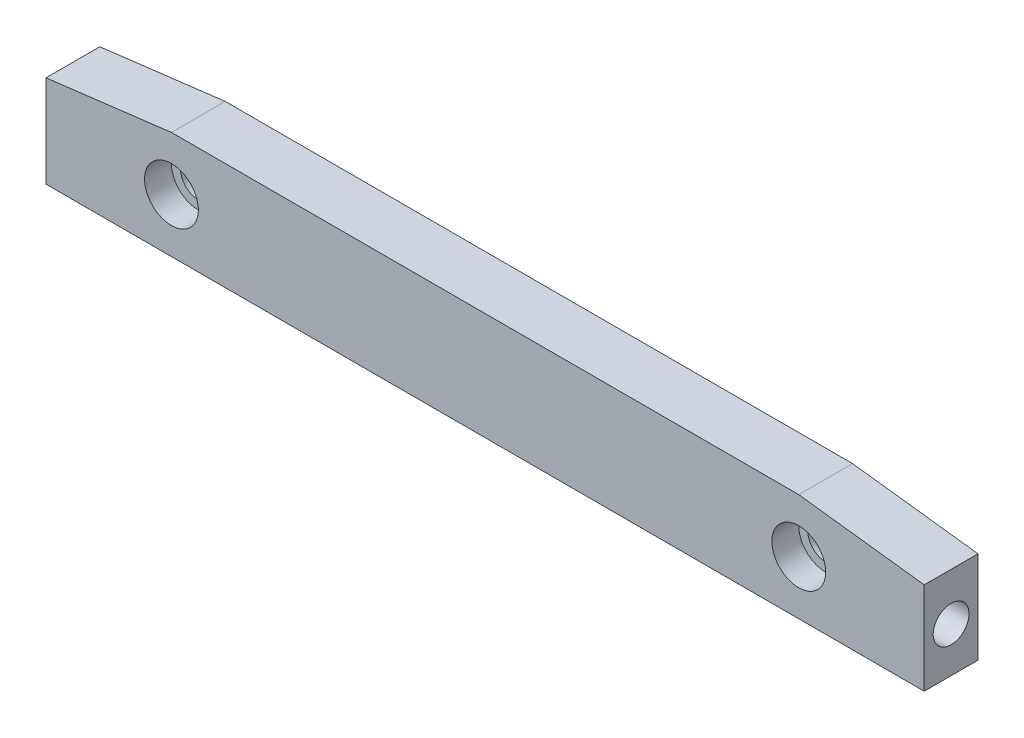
ISO-10303-21;
HEADER;
FILE_DESCRIPTION(('STEP AP214'),'2;1');
FILE_NAME('part.step','',(''),(''),'','','');
FILE_SCHEMA(('AUTOMOTIVE_DESIGN { 1 0 10303 214 1 1 1 1 }'));
ENDSEC;
DATA;
#1=APPLICATION_CONTEXT('core data for automotive mechanical design processes');
#2=APPLICATION_PROTOCOL_DEFINITION('international standard','automotive_design',2000,#1);
#3=PRODUCT_CONTEXT('',#1,'mechanical');
#4=PRODUCT('Part','Part','',(#3));
#5=PRODUCT_RELATED_PRODUCT_CATEGORY('part','',(#4));
#6=PRODUCT_DEFINITION_FORMATION('','',#4);
#7=PRODUCT_DEFINITION_CONTEXT('part definition',#1,'design');
#8=PRODUCT_DEFINITION('design','',#6,#7);
#9=PRODUCT_DEFINITION_SHAPE('','',#8);
#10=(LENGTH_UNIT() NAMED_UNIT(*) SI_UNIT(.MILLI.,.METRE.));
#11=(NAMED_UNIT(*) PLANE_ANGLE_UNIT() SI_UNIT($,.RADIAN.));
#12=(NAMED_UNIT(*) SI_UNIT($,.STERADIAN.) SOLID_ANGLE_UNIT());
#13=UNCERTAINTY_MEASURE_WITH_UNIT(LENGTH_MEASURE(1.E-05),#10,'distance_accuracy_value','');
#14=(GEOMETRIC_REPRESENTATION_CONTEXT(3) GLOBAL_UNCERTAINTY_ASSIGNED_CONTEXT((#13)) GLOBAL_UNIT_ASSIGNED_CONTEXT((#10,
#11,#12)) REPRESENTATION_CONTEXT('',''));
#15=CARTESIAN_POINT('',(0.,0.,0.));
#16=DIRECTION('',(0.,0.,1.));
#17=DIRECTION('',(1.,0.,0.));
#18=AXIS2_PLACEMENT_3D('',#15,#16,#17);
#19=CARTESIAN_POINT('',(0.,0.,4.7625));
#20=DIRECTION('',(0.,0.,1.));
#21=DIRECTION('',(1.,0.,0.));
#22=AXIS2_PLACEMENT_3D('',#19,#20,#21);
#23=PLANE('',#22);
#24=CARTESIAN_POINT('',(-55.5625,9.525,4.7625));
#25=DIRECTION('',(0.,0.,1.));
#26=DIRECTION('',(1.,0.,0.));
#27=AXIS2_PLACEMENT_3D('',#24,#25,#26);
#28=CIRCLE('',#27,4.7625);
#29=CARTESIAN_POINT('',(-60.325,9.525,4.7625));
#30=VERTEX_POINT('',#29);
#31=EDGE_CURVE('E126',#30,#30,#28,.F.);
#32=ORIENTED_EDGE('',*,*,#31,.T.);
#33=EDGE_LOOP('',(#32));
#34=FACE_BOUND('',#33,.T.);
#35=DIRECTION('',(0.,1.,0.));
#36=VECTOR('',#35,1.);
#37=CARTESIAN_POINT('',(77.7875,0.,4.7625));
#38=LINE('',#37,#36);
#39=CARTESIAN_POINT('',(77.7875,0.,4.7625));
#40=VERTEX_POINT('',#39);
#41=CARTESIAN_POINT('',(77.7875,16.3211131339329,4.7625));
#42=VERTEX_POINT('',#41);
#43=EDGE_CURVE('E135',#40,#42,#38,.T.);
#44=ORIENTED_EDGE('',*,*,#43,.T.);
#45=DIRECTION('',(0.992546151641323,-0.121869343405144,0.));
#46=VECTOR('',#45,1.);
#47=CARTESIAN_POINT('',(3.12952790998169,25.4879594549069,4.7625));
#48=LINE('',#47,#46);
#49=CARTESIAN_POINT('',(55.5625000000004,19.0499999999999,4.7625));
#50=VERTEX_POINT('',#49);
#51=EDGE_CURVE('E11',#42,#50,#48,.F.);
#52=ORIENTED_EDGE('',*,*,#51,.T.);
#53=DIRECTION('',(-1.,0.,0.));
#54=VECTOR('',#53,1.);
#55=CARTESIAN_POINT('',(77.7875,19.05,4.7625));
#56=LINE('',#55,#54);
#57=CARTESIAN_POINT('',(-55.562499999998,19.0500000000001,4.7625));
#58=VERTEX_POINT('',#57);
#59=EDGE_CURVE('E137',#50,#58,#56,.T.);
#60=ORIENTED_EDGE('',*,*,#59,.T.);
#61=DIRECTION('',(0.992546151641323,0.121869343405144,0.));
#62=VECTOR('',#61,1.);
#63=CARTESIAN_POINT('',(-3.1295279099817,25.4879594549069,4.7625));
#64=LINE('',#63,#62);
#65=CARTESIAN_POINT('',(-77.7875,16.3211131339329,4.7625));
#66=VERTEX_POINT('',#65);
#67=EDGE_CURVE('E168',#58,#66,#64,.F.);
#68=ORIENTED_EDGE('',*,*,#67,.T.);
#69=DIRECTION('',(0.,-1.,0.));
#70=VECTOR('',#69,1.);
#71=CARTESIAN_POINT('',(-77.7875,19.05,4.7625));
#72=LINE('',#71,#70);
#73=CARTESIAN_POINT('',(-77.7875,0.,4.7625));
#74=VERTEX_POINT('',#73);
#75=EDGE_CURVE('E130',#66,#74,#72,.T.);
#76=ORIENTED_EDGE('',*,*,#75,.T.);
#77=DIRECTION('',(1.,0.,0.));
#78=VECTOR('',#77,1.);
#79=CARTESIAN_POINT('',(-77.7875,0.,4.7625));
#80=LINE('',#79,#78);
#81=EDGE_CURVE('E132',#74,#40,#80,.T.);
#82=ORIENTED_EDGE('',*,*,#81,.T.);
#83=EDGE_LOOP('',(#44,#52,#60,#68,#76,#82));
#84=FACE_BOUND('',#83,.T.);
#85=CARTESIAN_POINT('',(55.5625,9.525,4.7625));
#86=DIRECTION('',(0.,0.,1.));
#87=DIRECTION('',(1.,0.,0.));
#88=AXIS2_PLACEMENT_3D('',#85,#86,#87);
#89=CIRCLE('',#88,4.7625);
#90=CARTESIAN_POINT('',(50.8,9.525,4.7625));
#91=VERTEX_POINT('',#90);
#92=EDGE_CURVE('E121',#91,#91,#89,.F.);
#93=ORIENTED_EDGE('',*,*,#92,.T.);
#94=EDGE_LOOP('',(#93));
#95=FACE_BOUND('',#94,.T.);
#96=ADVANCED_FACE('F35',(#34,#84,#95),#23,.T.);
#97=CARTESIAN_POINT('',(55.5625,9.525,4.7625));
#98=DIRECTION('',(0.,0.,-1.));
#99=DIRECTION('',(-1.,0.,0.));
#100=AXIS2_PLACEMENT_3D('',#97,#98,#99);
#101=CYLINDRICAL_SURFACE('',#100,3.175);
#102=CARTESIAN_POINT('',(55.5625,9.525,-4.7625));
#103=DIRECTION('',(0.,0.,1.));
#104=DIRECTION('',(1.,0.,0.));
#105=AXIS2_PLACEMENT_3D('',#102,#103,#104);
#106=CIRCLE('',#105,3.175);
#107=CARTESIAN_POINT('',(52.3875,9.525,-4.7625));
#108=VERTEX_POINT('',#107);
#109=EDGE_CURVE('E122',#108,#108,#106,.T.);
#110=CARTESIAN_POINT('',(55.5625,9.525,0.));
#111=DIRECTION('',(0.,0.,1.));
#112=DIRECTION('',(1.,0.,0.));
#113=AXIS2_PLACEMENT_3D('',#110,#111,#112);
#114=CIRCLE('',#113,3.175);
#115=CARTESIAN_POINT('',(52.3875,9.525,0.));
#116=VERTEX_POINT('',#115);
#117=EDGE_CURVE('E116',#116,#116,#114,.T.);
#118=CARTESIAN_POINT('',(52.3875,9.525,-4.7625));
#119=CARTESIAN_POINT('',(52.3875,9.525,-4.712890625));
#120=CARTESIAN_POINT('',(52.3875,9.525,-4.66328125));
#121=CARTESIAN_POINT('',(52.3875,9.525,-4.5640625));
#122=CARTESIAN_POINT('',(52.3875,9.525,-4.514453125));
#123=CARTESIAN_POINT('',(52.3875,9.525,-4.415234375));
#124=CARTESIAN_POINT('',(52.3875,9.525,-4.365625));
#125=CARTESIAN_POINT('',(52.3875,9.525,-4.26640625));
#126=CARTESIAN_POINT('',(52.3875,9.525,-4.216796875));
#127=CARTESIAN_POINT('',(52.3875,9.525,-4.117578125));
#128=CARTESIAN_POINT('',(52.3875,9.525,-4.06796875));
#129=CARTESIAN_POINT('',(52.3875,9.525,-3.96875));
#130=CARTESIAN_POINT('',(52.3875,9.525,-3.919140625));
#131=CARTESIAN_POINT('',(52.3875,9.525,-3.819921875));
#132=CARTESIAN_POINT('',(52.3875,9.525,-3.7703125));
#133=CARTESIAN_POINT('',(52.3875,9.525,-3.67109375));
#134=CARTESIAN_POINT('',(52.3875,9.525,-3.621484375));
#135=CARTESIAN_POINT('',(52.3875,9.525,-3.522265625));
#136=CARTESIAN_POINT('',(52.3875,9.525,-3.47265625));
#137=CARTESIAN_POINT('',(52.3875,9.525,-3.3734375));
#138=CARTESIAN_POINT('',(52.3875,9.525,-3.323828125));
#139=CARTESIAN_POINT('',(52.3875,9.525,-3.224609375));
#140=CARTESIAN_POINT('',(52.3875,9.525,-3.175));
#141=CARTESIAN_POINT('',(52.3875,9.525,-3.07578125));
#142=CARTESIAN_POINT('',(52.3875,9.525,-3.026171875));
#143=CARTESIAN_POINT('',(52.3875,9.525,-2.926953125));
#144=CARTESIAN_POINT('',(52.3875,9.525,-2.87734375));
#145=CARTESIAN_POINT('',(52.3875,9.525,-2.778125));
#146=CARTESIAN_POINT('',(52.3875,9.525,-2.728515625));
#147=CARTESIAN_POINT('',(52.3875,9.525,-2.629296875));
#148=CARTESIAN_POINT('',(52.3875,9.525,-2.5796875));
#149=CARTESIAN_POINT('',(52.3875,9.525,-2.48046875));
#150=CARTESIAN_POINT('',(52.3875,9.525,-2.430859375));
#151=CARTESIAN_POINT('',(52.3875,9.525,-2.331640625));
#152=CARTESIAN_POINT('',(52.3875,9.525,-2.28203125));
#153=CARTESIAN_POINT('',(52.3875,9.525,-2.1828125));
#154=CARTESIAN_POINT('',(52.3875,9.525,-2.133203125));
#155=CARTESIAN_POINT('',(52.3875,9.525,-2.033984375));
#156=CARTESIAN_POINT('',(52.3875,9.525,-1.984375));
#157=CARTESIAN_POINT('',(52.3875,9.525,-1.88515625));
#158=CARTESIAN_POINT('',(52.3875,9.525,-1.835546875));
#159=CARTESIAN_POINT('',(52.3875,9.525,-1.736328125));
#160=CARTESIAN_POINT('',(52.3875,9.525,-1.68671875));
#161=CARTESIAN_POINT('',(52.3875,9.525,-1.5875));
#162=CARTESIAN_POINT('',(52.3875,9.525,-1.537890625));
#163=CARTESIAN_POINT('',(52.3875,9.525,-1.438671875));
#164=CARTESIAN_POINT('',(52.3875,9.525,-1.3890625));
#165=CARTESIAN_POINT('',(52.3875,9.525,-1.28984375));
#166=CARTESIAN_POINT('',(52.3875,9.525,-1.240234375));
#167=CARTESIAN_POINT('',(52.3875,9.525,-1.141015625));
#168=CARTESIAN_POINT('',(52.3875,9.525,-1.09140625));
#169=CARTESIAN_POINT('',(52.3875,9.525,-0.992187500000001));
#170=CARTESIAN_POINT('',(52.3875,9.525,-0.942578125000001));
#171=CARTESIAN_POINT('',(52.3875,9.525,-0.843359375));
#172=CARTESIAN_POINT('',(52.3875,9.525,-0.793750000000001));
#173=CARTESIAN_POINT('',(52.3875,9.525,-0.69453125));
#174=CARTESIAN_POINT('',(52.3875,9.525,-0.644921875));
#175=CARTESIAN_POINT('',(52.3875,9.525,-0.545703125));
#176=CARTESIAN_POINT('',(52.3875,9.525,-0.49609375));
#177=CARTESIAN_POINT('',(52.3875,9.525,-0.396875));
#178=CARTESIAN_POINT('',(52.3875,9.525,-0.347265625));
#179=CARTESIAN_POINT('',(52.3875,9.525,-0.248046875));
#180=CARTESIAN_POINT('',(52.3875,9.525,-0.1984375));
#181=CARTESIAN_POINT('',(52.3875,9.525,-0.09921875));
#182=CARTESIAN_POINT('',(52.3875,9.525,-0.049609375));
#183=CARTESIAN_POINT('',(52.3875,9.525,0.));
#184=B_SPLINE_CURVE_WITH_KNOTS('',3,(#118,#119,#120,#121,#122,#123,#124,#125,#126,#127,#128,
#129,#130,#131,#132,#133,#134,#135,#136,#137,#138,#139,#140,#141,#142,#143,#144,#145,#146,#147,
#148,#149,#150,#151,#152,#153,#154,#155,#156,#157,#158,#159,#160,#161,#162,#163,#164,#165,#166,
#167,#168,#169,#170,#171,#172,#173,#174,#175,#176,#177,#178,#179,#180,#181,#182,#183),
.UNSPECIFIED.,.F.,.F.,(4,2,2,2,2,2,2,2,2,2,2,2,2,2,2,2,2,2,2,2,2,2,2,2,2,2,2,2,2,2,2,2,4),(0.,
0.148828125,0.29765625,0.446484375,0.5953125,0.744140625,0.892968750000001,1.041796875,1.190625,
1.339453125,1.48828125,1.637109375,1.7859375,1.934765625,2.08359375,2.232421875,2.38125,
2.530078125,2.67890625,2.827734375,2.9765625,3.125390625,3.27421875,3.423046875,3.571875,
3.720703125,3.86953125,4.018359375,4.1671875,4.316015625,4.46484375,4.613671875,4.7625),.UNSPECIFIED.);
#185=EDGE_CURVE('BSEAM203',#108,#116,#184,.T.);
#186=ORIENTED_EDGE('',*,*,#109,.F.);
#187=ORIENTED_EDGE('',*,*,#117,.T.);
#188=ORIENTED_EDGE('',*,*,#185,.T.);
#189=ORIENTED_EDGE('',*,*,#185,.F.);
#190=EDGE_LOOP('',(#186,#188,#187,#189));
#191=FACE_BOUND('',#190,.T.);
#192=ADVANCED_FACE('F203',(#191),#101,.F.);
#193=CARTESIAN_POINT('',(-55.5625,9.525,4.7625));
#194=DIRECTION('',(0.,0.,-1.));
#195=DIRECTION('',(-1.,0.,0.));
#196=AXIS2_PLACEMENT_3D('',#193,#194,#195);
#197=CYLINDRICAL_SURFACE('',#196,3.175);
#198=CARTESIAN_POINT('',(-55.5625,9.525,-4.7625));
#199=DIRECTION('',(0.,0.,1.));
#200=DIRECTION('',(1.,0.,0.));
#201=AXIS2_PLACEMENT_3D('',#198,#199,#200);
#202=CIRCLE('',#201,3.175);
#203=CARTESIAN_POINT('',(-58.7375,9.525,-4.7625));
#204=VERTEX_POINT('',#203);
#205=EDGE_CURVE('E125',#204,#204,#202,.T.);
#206=CARTESIAN_POINT('',(-55.5625,9.525,0.));
#207=DIRECTION('',(0.,0.,1.));
#208=DIRECTION('',(1.,0.,0.));
#209=AXIS2_PLACEMENT_3D('',#206,#207,#208);
#210=CIRCLE('',#209,3.175);
#211=CARTESIAN_POINT('',(-58.7375,9.525,0.));
#212=VERTEX_POINT('',#211);
#213=EDGE_CURVE('E120',#212,#212,#210,.T.);
#214=CARTESIAN_POINT('',(-58.7375,9.525,-4.7625));
#215=CARTESIAN_POINT('',(-58.7375,9.525,-4.712890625));
#216=CARTESIAN_POINT('',(-58.7375,9.525,-4.66328125));
#217=CARTESIAN_POINT('',(-58.7375,9.525,-4.5640625));
#218=CARTESIAN_POINT('',(-58.7375,9.525,-4.514453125));
#219=CARTESIAN_POINT('',(-58.7375,9.525,-4.415234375));
#220=CARTESIAN_POINT('',(-58.7375,9.525,-4.365625));
#221=CARTESIAN_POINT('',(-58.7375,9.525,-4.26640625));
#222=CARTESIAN_POINT('',(-58.7375,9.525,-4.216796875));
#223=CARTESIAN_POINT('',(-58.7375,9.525,-4.117578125));
#224=CARTESIAN_POINT('',(-58.7375,9.525,-4.06796875));
#225=CARTESIAN_POINT('',(-58.7375,9.525,-3.96875));
#226=CARTESIAN_POINT('',(-58.7375,9.525,-3.919140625));
#227=CARTESIAN_POINT('',(-58.7375,9.525,-3.819921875));
#228=CARTESIAN_POINT('',(-58.7375,9.525,-3.7703125));
#229=CARTESIAN_POINT('',(-58.7375,9.525,-3.67109375));
#230=CARTESIAN_POINT('',(-58.7375,9.525,-3.621484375));
#231=CARTESIAN_POINT('',(-58.7375,9.525,-3.522265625));
#232=CARTESIAN_POINT('',(-58.7375,9.525,-3.47265625));
#233=CARTESIAN_POINT('',(-58.7375,9.525,-3.3734375));
#234=CARTESIAN_POINT('',(-58.7375,9.525,-3.323828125));
#235=CARTESIAN_POINT('',(-58.7375,9.525,-3.224609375));
#236=CARTESIAN_POINT('',(-58.7375,9.525,-3.175));
#237=CARTESIAN_POINT('',(-58.7375,9.525,-3.07578125));
#238=CARTESIAN_POINT('',(-58.7375,9.525,-3.026171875));
#239=CARTESIAN_POINT('',(-58.7375,9.525,-2.926953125));
#240=CARTESIAN_POINT('',(-58.7375,9.525,-2.87734375));
#241=CARTESIAN_POINT('',(-58.7375,9.525,-2.778125));
#242=CARTESIAN_POINT('',(-58.7375,9.525,-2.728515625));
#243=CARTESIAN_POINT('',(-58.7375,9.525,-2.629296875));
#244=CARTESIAN_POINT('',(-58.7375,9.525,-2.5796875));
#245=CARTESIAN_POINT('',(-58.7375,9.525,-2.48046875));
#246=CARTESIAN_POINT('',(-58.7375,9.525,-2.430859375));
#247=CARTESIAN_POINT('',(-58.7375,9.525,-2.331640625));
#248=CARTESIAN_POINT('',(-58.7375,9.525,-2.28203125));
#249=CARTESIAN_POINT('',(-58.7375,9.525,-2.1828125));
#250=CARTESIAN_POINT('',(-58.7375,9.525,-2.133203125));
#251=CARTESIAN_POINT('',(-58.7375,9.525,-2.033984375));
#252=CARTESIAN_POINT('',(-58.7375,9.525,-1.984375));
#253=CARTESIAN_POINT('',(-58.7375,9.525,-1.88515625));
#254=CARTESIAN_POINT('',(-58.7375,9.525,-1.835546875));
#255=CARTESIAN_POINT('',(-58.7375,9.525,-1.736328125));
#256=CARTESIAN_POINT('',(-58.7375,9.525,-1.68671875));
#257=CARTESIAN_POINT('',(-58.7375,9.525,-1.5875));
#258=CARTESIAN_POINT('',(-58.7375,9.525,-1.537890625));
#259=CARTESIAN_POINT('',(-58.7375,9.525,-1.438671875));
#260=CARTESIAN_POINT('',(-58.7375,9.525,-1.3890625));
#261=CARTESIAN_POINT('',(-58.7375,9.525,-1.28984375));
#262=CARTESIAN_POINT('',(-58.7375,9.525,-1.240234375));
#263=CARTESIAN_POINT('',(-58.7375,9.525,-1.141015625));
#264=CARTESIAN_POINT('',(-58.7375,9.525,-1.09140625));
#265=CARTESIAN_POINT('',(-58.7375,9.525,-0.992187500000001));
#266=CARTESIAN_POINT('',(-58.7375,9.525,-0.942578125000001));
#267=CARTESIAN_POINT('',(-58.7375,9.525,-0.843359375));
#268=CARTESIAN_POINT('',(-58.7375,9.525,-0.793750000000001));
#269=CARTESIAN_POINT('',(-58.7375,9.525,-0.69453125));
#270=CARTESIAN_POINT('',(-58.7375,9.525,-0.644921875));
#271=CARTESIAN_POINT('',(-58.7375,9.525,-0.545703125));
#272=CARTESIAN_POINT('',(-58.7375,9.525,-0.49609375));
#273=CARTESIAN_POINT('',(-58.7375,9.525,-0.396875));
#274=CARTESIAN_POINT('',(-58.7375,9.525,-0.347265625));
#275=CARTESIAN_POINT('',(-58.7375,9.525,-0.248046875));
#276=CARTESIAN_POINT('',(-58.7375,9.525,-0.1984375));
#277=CARTESIAN_POINT('',(-58.7375,9.525,-0.09921875));
#278=CARTESIAN_POINT('',(-58.7375,9.525,-0.049609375));
#279=CARTESIAN_POINT('',(-58.7375,9.525,0.));
#280=B_SPLINE_CURVE_WITH_KNOTS('',3,(#214,#215,#216,#217,#218,#219,#220,#221,#222,#223,#224,
#225,#226,#227,#228,#229,#230,#231,#232,#233,#234,#235,#236,#237,#238,#239,#240,#241,#242,#243,
#244,#245,#246,#247,#248,#249,#250,#251,#252,#253,#254,#255,#256,#257,#258,#259,#260,#261,#262,
#263,#264,#265,#266,#267,#268,#269,#270,#271,#272,#273,#274,#275,#276,#277,#278,#279),
.UNSPECIFIED.,.F.,.F.,(4,2,2,2,2,2,2,2,2,2,2,2,2,2,2,2,2,2,2,2,2,2,2,2,2,2,2,2,2,2,2,2,4),(0.,
0.148828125,0.29765625,0.446484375,0.5953125,0.744140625,0.892968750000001,1.041796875,1.190625,
1.339453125,1.48828125,1.637109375,1.7859375,1.934765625,2.08359375,2.232421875,2.38125,
2.530078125,2.67890625,2.827734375,2.9765625,3.125390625,3.27421875,3.423046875,3.571875,
3.720703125,3.86953125,4.018359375,4.1671875,4.316015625,4.46484375,4.613671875,4.7625),.UNSPECIFIED.);
#281=EDGE_CURVE('BSEAM209',#204,#212,#280,.T.);
#282=ORIENTED_EDGE('',*,*,#205,.F.);
#283=ORIENTED_EDGE('',*,*,#213,.T.);
#284=ORIENTED_EDGE('',*,*,#281,.T.);
#285=ORIENTED_EDGE('',*,*,#281,.F.);
#286=EDGE_LOOP('',(#282,#284,#283,#285));
#287=FACE_BOUND('',#286,.T.);
#288=ADVANCED_FACE('F209',(#287),#197,.F.);
#289=CARTESIAN_POINT('',(0.,0.,-4.7625));
#290=DIRECTION('',(0.,0.,1.));
#291=DIRECTION('',(1.,0.,0.));
#292=AXIS2_PLACEMENT_3D('',#289,#290,#291);
#293=PLANE('',#292);
#294=ORIENTED_EDGE('',*,*,#205,.T.);
#295=EDGE_LOOP('',(#294));
#296=FACE_BOUND('',#295,.T.);
#297=DIRECTION('',(-1.,0.,0.));
#298=VECTOR('',#297,1.);
#299=CARTESIAN_POINT('',(77.7875,19.05,-4.7625));
#300=LINE('',#299,#298);
#301=CARTESIAN_POINT('',(55.5624999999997,19.05,-4.7625));
#302=VERTEX_POINT('',#301);
#303=CARTESIAN_POINT('',(-55.5624999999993,19.05,-4.7625));
#304=VERTEX_POINT('',#303);
#305=EDGE_CURVE('E133',#302,#304,#300,.T.);
#306=ORIENTED_EDGE('',*,*,#305,.F.);
#307=DIRECTION('',(-0.992546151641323,0.121869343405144,0.));
#308=VECTOR('',#307,1.);
#309=CARTESIAN_POINT('',(55.5624999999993,19.05,-4.7625));
#310=LINE('',#309,#308);
#311=CARTESIAN_POINT('',(77.7875,16.3211131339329,-4.7625));
#312=VERTEX_POINT('',#311);
#313=EDGE_CURVE('E57',#302,#312,#310,.F.);
#314=ORIENTED_EDGE('',*,*,#313,.T.);
#315=DIRECTION('',(0.,1.,0.));
#316=VECTOR('',#315,1.);
#317=CARTESIAN_POINT('',(77.7875,0.,-4.7625));
#318=LINE('',#317,#316);
#319=CARTESIAN_POINT('',(77.7875,0.,-4.7625));
#320=VERTEX_POINT('',#319);
#321=EDGE_CURVE('E143',#320,#312,#318,.T.);
#322=ORIENTED_EDGE('',*,*,#321,.F.);
#323=DIRECTION('',(1.,0.,0.));
#324=VECTOR('',#323,1.);
#325=CARTESIAN_POINT('',(0.,0.,-4.7625));
#326=LINE('',#325,#324);
#327=CARTESIAN_POINT('',(-77.7875,0.,-4.7625));
#328=VERTEX_POINT('',#327);
#329=EDGE_CURVE('E141',#328,#320,#326,.T.);
#330=ORIENTED_EDGE('',*,*,#329,.F.);
#331=DIRECTION('',(0.,-1.,0.));
#332=VECTOR('',#331,1.);
#333=CARTESIAN_POINT('',(-77.7875,19.05,-4.7625));
#334=LINE('',#333,#332);
#335=CARTESIAN_POINT('',(-77.7875,16.3211131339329,-4.7625));
#336=VERTEX_POINT('',#335);
#337=EDGE_CURVE('E129',#336,#328,#334,.T.);
#338=ORIENTED_EDGE('',*,*,#337,.F.);
#339=DIRECTION('',(-0.992546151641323,-0.121869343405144,0.));
#340=VECTOR('',#339,1.);
#341=CARTESIAN_POINT('',(-77.7875,16.3211131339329,-4.7625));
#342=LINE('',#341,#340);
#343=EDGE_CURVE('E162',#336,#304,#342,.F.);
#344=ORIENTED_EDGE('',*,*,#343,.T.);
#345=EDGE_LOOP('',(#306,#314,#322,#330,#338,#344));
#346=FACE_BOUND('',#345,.T.);
#347=ORIENTED_EDGE('',*,*,#109,.T.);
#348=EDGE_LOOP('',(#347));
#349=FACE_BOUND('',#348,.T.);
#350=ADVANCED_FACE('F179',(#296,#346,#349),#293,.F.);
#351=CARTESIAN_POINT('',(-77.7875,19.05,4.7625));
#352=DIRECTION('',(1.,0.,0.));
#353=DIRECTION('',(0.,0.,-1.));
#354=AXIS2_PLACEMENT_3D('',#351,#352,#353);
#355=PLANE('',#354);
#356=CARTESIAN_POINT('',(-77.7875,7.9248,0.));
#357=DIRECTION('',(-1.,0.,0.));
#358=DIRECTION('',(0.,0.,1.));
#359=AXIS2_PLACEMENT_3D('',#356,#357,#358);
#360=CIRCLE('',#359,3.175);
#361=CARTESIAN_POINT('',(-77.7875,7.9248,3.175));
#362=VERTEX_POINT('',#361);
#363=EDGE_CURVE('E102',#362,#362,#360,.T.);
#364=ORIENTED_EDGE('',*,*,#363,.F.);
#365=EDGE_LOOP('',(#364));
#366=FACE_BOUND('',#365,.T.);
#367=ORIENTED_EDGE('',*,*,#75,.F.);
#368=DIRECTION('',(0.,0.,-1.));
#369=VECTOR('',#368,1.);
#370=CARTESIAN_POINT('',(-77.7875,16.3211131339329,4.7625));
#371=LINE('',#370,#369);
#372=EDGE_CURVE('E151',#66,#336,#371,.T.);
#373=ORIENTED_EDGE('',*,*,#372,.T.);
#374=ORIENTED_EDGE('',*,*,#337,.T.);
#375=DIRECTION('',(0.,0.,-1.));
#376=VECTOR('',#375,1.);
#377=CARTESIAN_POINT('',(-77.7875,0.,4.7625));
#378=LINE('',#377,#376);
#379=EDGE_CURVE('E148',#74,#328,#378,.T.);
#380=ORIENTED_EDGE('',*,*,#379,.F.);
#381=EDGE_LOOP('',(#367,#373,#374,#380));
#382=FACE_BOUND('',#381,.T.);
#383=ADVANCED_FACE('F194',(#366,#382),#355,.F.);
#384=CARTESIAN_POINT('',(0.,0.,4.7625));
#385=DIRECTION('',(0.,1.,0.));
#386=DIRECTION('',(0.,0.,1.));
#387=AXIS2_PLACEMENT_3D('',#384,#385,#386);
#388=PLANE('',#387);
#389=ORIENTED_EDGE('',*,*,#329,.T.);
#390=DIRECTION('',(0.,0.,-1.));
#391=VECTOR('',#390,1.);
#392=CARTESIAN_POINT('',(77.7875,0.,4.7625));
#393=LINE('',#392,#391);
#394=EDGE_CURVE('E139',#40,#320,#393,.T.);
#395=ORIENTED_EDGE('',*,*,#394,.F.);
#396=ORIENTED_EDGE('',*,*,#81,.F.);
#397=ORIENTED_EDGE('',*,*,#379,.T.);
#398=EDGE_LOOP('',(#389,#395,#396,#397));
#399=FACE_BOUND('',#398,.T.);
#400=ADVANCED_FACE('F196',(#399),#388,.F.);
#401=CARTESIAN_POINT('',(77.7875,0.,4.7625));
#402=DIRECTION('',(-1.,0.,0.));
#403=DIRECTION('',(0.,0.,1.));
#404=AXIS2_PLACEMENT_3D('',#401,#402,#403);
#405=PLANE('',#404);
#406=CARTESIAN_POINT('',(77.7875,7.9248,0.));
#407=DIRECTION('',(1.,0.,0.));
#408=DIRECTION('',(0.,0.,-1.));
#409=AXIS2_PLACEMENT_3D('',#406,#407,#408);
#410=CIRCLE('',#409,3.17499999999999);
#411=CARTESIAN_POINT('',(77.7875,7.9248,-3.17499999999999));
#412=VERTEX_POINT('',#411);
#413=EDGE_CURVE('E103',#412,#412,#410,.T.);
#414=ORIENTED_EDGE('',*,*,#413,.F.);
#415=EDGE_LOOP('',(#414));
#416=FACE_BOUND('',#415,.T.);
#417=ORIENTED_EDGE('',*,*,#321,.T.);
#418=DIRECTION('',(0.,0.,1.));
#419=VECTOR('',#418,1.);
#420=CARTESIAN_POINT('',(77.7875,16.3211131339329,4.7625));
#421=LINE('',#420,#419);
#422=EDGE_CURVE('E43',#312,#42,#421,.T.);
#423=ORIENTED_EDGE('',*,*,#422,.T.);
#424=ORIENTED_EDGE('',*,*,#43,.F.);
#425=ORIENTED_EDGE('',*,*,#394,.T.);
#426=EDGE_LOOP('',(#417,#423,#424,#425));
#427=FACE_BOUND('',#426,.T.);
#428=ADVANCED_FACE('F220',(#416,#427),#405,.F.);
#429=CARTESIAN_POINT('',(77.7875,19.05,4.7625));
#430=DIRECTION('',(0.,-1.,0.));
#431=DIRECTION('',(1.,0.,0.));
#432=AXIS2_PLACEMENT_3D('',#429,#430,#431);
#433=PLANE('',#432);
#434=ORIENTED_EDGE('',*,*,#59,.F.);
#435=DIRECTION('',(0.,0.,-1.));
#436=VECTOR('',#435,1.);
#437=CARTESIAN_POINT('',(55.5624999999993,19.05,4.7625));
#438=LINE('',#437,#436);
#439=EDGE_CURVE('E170',#50,#302,#438,.T.);
#440=ORIENTED_EDGE('',*,*,#439,.T.);
#441=ORIENTED_EDGE('',*,*,#305,.T.);
#442=DIRECTION('',(0.,0.,1.));
#443=VECTOR('',#442,1.);
#444=CARTESIAN_POINT('',(-55.5624999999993,19.05,4.7625));
#445=LINE('',#444,#443);
#446=EDGE_CURVE('E165',#304,#58,#445,.T.);
#447=ORIENTED_EDGE('',*,*,#446,.T.);
#448=EDGE_LOOP('',(#434,#440,#441,#447));
#449=FACE_BOUND('',#448,.T.);
#450=ADVANCED_FACE('F176',(#449),#433,.F.);
#451=CARTESIAN_POINT('',(-55.5625,9.525,9.525));
#452=DIRECTION('',(0.,0.,-1.));
#453=DIRECTION('',(-1.,0.,0.));
#454=AXIS2_PLACEMENT_3D('',#451,#452,#453);
#455=CYLINDRICAL_SURFACE('',#454,4.7625);
#456=CARTESIAN_POINT('',(-55.5625,9.525,0.));
#457=DIRECTION('',(0.,0.,1.));
#458=DIRECTION('',(1.,0.,0.));
#459=AXIS2_PLACEMENT_3D('',#456,#457,#458);
#460=CIRCLE('',#459,4.7625);
#461=CARTESIAN_POINT('',(-60.325,9.525,0.));
#462=VERTEX_POINT('',#461);
#463=EDGE_CURVE('E117',#462,#462,#460,.T.);
#464=CARTESIAN_POINT('',(-60.325,9.525,4.7625));
#465=CARTESIAN_POINT('',(-60.325,9.525,4.712890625));
#466=CARTESIAN_POINT('',(-60.325,9.525,4.66328125));
#467=CARTESIAN_POINT('',(-60.325,9.525,4.5640625));
#468=CARTESIAN_POINT('',(-60.325,9.525,4.514453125));
#469=CARTESIAN_POINT('',(-60.325,9.525,4.415234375));
#470=CARTESIAN_POINT('',(-60.325,9.525,4.365625));
#471=CARTESIAN_POINT('',(-60.325,9.525,4.26640625));
#472=CARTESIAN_POINT('',(-60.325,9.525,4.216796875));
#473=CARTESIAN_POINT('',(-60.325,9.525,4.117578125));
#474=CARTESIAN_POINT('',(-60.325,9.525,4.06796875));
#475=CARTESIAN_POINT('',(-60.325,9.525,3.96875));
#476=CARTESIAN_POINT('',(-60.325,9.525,3.919140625));
#477=CARTESIAN_POINT('',(-60.325,9.525,3.819921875));
#478=CARTESIAN_POINT('',(-60.325,9.525,3.7703125));
#479=CARTESIAN_POINT('',(-60.325,9.525,3.67109375));
#480=CARTESIAN_POINT('',(-60.325,9.525,3.621484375));
#481=CARTESIAN_POINT('',(-60.325,9.525,3.522265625));
#482=CARTESIAN_POINT('',(-60.325,9.525,3.47265625));
#483=CARTESIAN_POINT('',(-60.325,9.525,3.3734375));
#484=CARTESIAN_POINT('',(-60.325,9.525,3.323828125));
#485=CARTESIAN_POINT('',(-60.325,9.525,3.224609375));
#486=CARTESIAN_POINT('',(-60.325,9.525,3.175));
#487=CARTESIAN_POINT('',(-60.325,9.525,3.07578125));
#488=CARTESIAN_POINT('',(-60.325,9.525,3.026171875));
#489=CARTESIAN_POINT('',(-60.325,9.525,2.926953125));
#490=CARTESIAN_POINT('',(-60.325,9.525,2.87734375));
#491=CARTESIAN_POINT('',(-60.325,9.525,2.778125));
#492=CARTESIAN_POINT('',(-60.325,9.525,2.728515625));
#493=CARTESIAN_POINT('',(-60.325,9.525,2.629296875));
#494=CARTESIAN_POINT('',(-60.325,9.525,2.5796875));
#495=CARTESIAN_POINT('',(-60.325,9.525,2.48046875));
#496=CARTESIAN_POINT('',(-60.325,9.525,2.430859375));
#497=CARTESIAN_POINT('',(-60.325,9.525,2.331640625));
#498=CARTESIAN_POINT('',(-60.325,9.525,2.28203125));
#499=CARTESIAN_POINT('',(-60.325,9.525,2.1828125));
#500=CARTESIAN_POINT('',(-60.325,9.525,2.133203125));
#501=CARTESIAN_POINT('',(-60.325,9.525,2.033984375));
#502=CARTESIAN_POINT('',(-60.325,9.525,1.984375));
#503=CARTESIAN_POINT('',(-60.325,9.525,1.88515625));
#504=CARTESIAN_POINT('',(-60.325,9.525,1.835546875));
#505=CARTESIAN_POINT('',(-60.325,9.525,1.736328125));
#506=CARTESIAN_POINT('',(-60.325,9.525,1.68671875));
#507=CARTESIAN_POINT('',(-60.325,9.525,1.5875));
#508=CARTESIAN_POINT('',(-60.325,9.525,1.537890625));
#509=CARTESIAN_POINT('',(-60.325,9.525,1.438671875));
#510=CARTESIAN_POINT('',(-60.325,9.525,1.3890625));
#511=CARTESIAN_POINT('',(-60.325,9.525,1.28984375));
#512=CARTESIAN_POINT('',(-60.325,9.525,1.240234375));
#513=CARTESIAN_POINT('',(-60.325,9.525,1.141015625));
#514=CARTESIAN_POINT('',(-60.325,9.525,1.09140625));
#515=CARTESIAN_POINT('',(-60.325,9.525,0.992187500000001));
#516=CARTESIAN_POINT('',(-60.325,9.525,0.942578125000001));
#517=CARTESIAN_POINT('',(-60.325,9.525,0.843359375));
#518=CARTESIAN_POINT('',(-60.325,9.525,0.793750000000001));
#519=CARTESIAN_POINT('',(-60.325,9.525,0.69453125));
#520=CARTESIAN_POINT('',(-60.325,9.525,0.644921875));
#521=CARTESIAN_POINT('',(-60.325,9.525,0.545703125));
#522=CARTESIAN_POINT('',(-60.325,9.525,0.49609375));
#523=CARTESIAN_POINT('',(-60.325,9.525,0.396875));
#524=CARTESIAN_POINT('',(-60.325,9.525,0.347265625));
#525=CARTESIAN_POINT('',(-60.325,9.525,0.248046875));
#526=CARTESIAN_POINT('',(-60.325,9.525,0.1984375));
#527=CARTESIAN_POINT('',(-60.325,9.525,0.09921875));
#528=CARTESIAN_POINT('',(-60.325,9.525,0.049609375));
#529=CARTESIAN_POINT('',(-60.325,9.525,0.));
#530=B_SPLINE_CURVE_WITH_KNOTS('',3,(#464,#465,#466,#467,#468,#469,#470,#471,#472,#473,#474,
#475,#476,#477,#478,#479,#480,#481,#482,#483,#484,#485,#486,#487,#488,#489,#490,#491,#492,#493,
#494,#495,#496,#497,#498,#499,#500,#501,#502,#503,#504,#505,#506,#507,#508,#509,#510,#511,#512,
#513,#514,#515,#516,#517,#518,#519,#520,#521,#522,#523,#524,#525,#526,#527,#528,#529),
.UNSPECIFIED.,.F.,.F.,(4,2,2,2,2,2,2,2,2,2,2,2,2,2,2,2,2,2,2,2,2,2,2,2,2,2,2,2,2,2,2,2,4),(0.,
0.148828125,0.29765625,0.446484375,0.5953125,0.744140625,0.892968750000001,1.041796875,1.190625,
1.339453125,1.48828125,1.637109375,1.7859375,1.934765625,2.08359375,2.232421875,2.38125,
2.530078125,2.67890625,2.827734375,2.9765625,3.125390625,3.27421875,3.423046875,3.571875,
3.720703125,3.86953125,4.018359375,4.1671875,4.316015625,4.46484375,4.613671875,4.7625),.UNSPECIFIED.);
#531=EDGE_CURVE('BSEAM219',#30,#462,#530,.T.);
#532=ORIENTED_EDGE('',*,*,#31,.F.);
#533=ORIENTED_EDGE('',*,*,#463,.F.);
#534=ORIENTED_EDGE('',*,*,#531,.T.);
#535=ORIENTED_EDGE('',*,*,#531,.F.);
#536=EDGE_LOOP('',(#532,#534,#533,#535));
#537=FACE_BOUND('',#536,.T.);
#538=ADVANCED_FACE('F219',(#537),#455,.F.);
#539=CARTESIAN_POINT('',(-55.5625,9.525,0.));
#540=DIRECTION('',(0.,0.,1.));
#541=DIRECTION('',(1.,0.,0.));
#542=AXIS2_PLACEMENT_3D('',#539,#540,#541);
#543=PLANE('',#542);
#544=ORIENTED_EDGE('',*,*,#213,.F.);
#545=EDGE_LOOP('',(#544));
#546=FACE_BOUND('',#545,.T.);
#547=ORIENTED_EDGE('',*,*,#463,.T.);
#548=EDGE_LOOP('',(#547));
#549=FACE_BOUND('',#548,.T.);
#550=ADVANCED_FACE('F251',(#546,#549),#543,.T.);
#551=CARTESIAN_POINT('',(55.5625,9.525,9.525));
#552=DIRECTION('',(0.,0.,-1.));
#553=DIRECTION('',(-1.,0.,0.));
#554=AXIS2_PLACEMENT_3D('',#551,#552,#553);
#555=CYLINDRICAL_SURFACE('',#554,4.7625);
#556=CARTESIAN_POINT('',(55.5625,9.525,0.));
#557=DIRECTION('',(0.,0.,1.));
#558=DIRECTION('',(1.,0.,0.));
#559=AXIS2_PLACEMENT_3D('',#556,#557,#558);
#560=CIRCLE('',#559,4.7625);
#561=CARTESIAN_POINT('',(50.8,9.525,0.));
#562=VERTEX_POINT('',#561);
#563=EDGE_CURVE('E113',#562,#562,#560,.T.);
#564=CARTESIAN_POINT('',(50.8,9.525,4.7625));
#565=CARTESIAN_POINT('',(50.8,9.525,4.712890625));
#566=CARTESIAN_POINT('',(50.8,9.525,4.66328125));
#567=CARTESIAN_POINT('',(50.8,9.525,4.5640625));
#568=CARTESIAN_POINT('',(50.8,9.525,4.514453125));
#569=CARTESIAN_POINT('',(50.8,9.525,4.415234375));
#570=CARTESIAN_POINT('',(50.8,9.525,4.365625));
#571=CARTESIAN_POINT('',(50.8,9.525,4.26640625));
#572=CARTESIAN_POINT('',(50.8,9.525,4.216796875));
#573=CARTESIAN_POINT('',(50.8,9.525,4.117578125));
#574=CARTESIAN_POINT('',(50.8,9.525,4.06796875));
#575=CARTESIAN_POINT('',(50.8,9.525,3.96875));
#576=CARTESIAN_POINT('',(50.8,9.525,3.919140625));
#577=CARTESIAN_POINT('',(50.8,9.525,3.819921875));
#578=CARTESIAN_POINT('',(50.8,9.525,3.7703125));
#579=CARTESIAN_POINT('',(50.8,9.525,3.67109375));
#580=CARTESIAN_POINT('',(50.8,9.525,3.621484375));
#581=CARTESIAN_POINT('',(50.8,9.525,3.522265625));
#582=CARTESIAN_POINT('',(50.8,9.525,3.47265625));
#583=CARTESIAN_POINT('',(50.8,9.525,3.3734375));
#584=CARTESIAN_POINT('',(50.8,9.525,3.323828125));
#585=CARTESIAN_POINT('',(50.8,9.525,3.224609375));
#586=CARTESIAN_POINT('',(50.8,9.525,3.175));
#587=CARTESIAN_POINT('',(50.8,9.525,3.07578125));
#588=CARTESIAN_POINT('',(50.8,9.525,3.026171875));
#589=CARTESIAN_POINT('',(50.8,9.525,2.926953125));
#590=CARTESIAN_POINT('',(50.8,9.525,2.87734375));
#591=CARTESIAN_POINT('',(50.8,9.525,2.778125));
#592=CARTESIAN_POINT('',(50.8,9.525,2.728515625));
#593=CARTESIAN_POINT('',(50.8,9.525,2.629296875));
#594=CARTESIAN_POINT('',(50.8,9.525,2.5796875));
#595=CARTESIAN_POINT('',(50.8,9.525,2.48046875));
#596=CARTESIAN_POINT('',(50.8,9.525,2.430859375));
#597=CARTESIAN_POINT('',(50.8,9.525,2.331640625));
#598=CARTESIAN_POINT('',(50.8,9.525,2.28203125));
#599=CARTESIAN_POINT('',(50.8,9.525,2.1828125));
#600=CARTESIAN_POINT('',(50.8,9.525,2.133203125));
#601=CARTESIAN_POINT('',(50.8,9.525,2.033984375));
#602=CARTESIAN_POINT('',(50.8,9.525,1.984375));
#603=CARTESIAN_POINT('',(50.8,9.525,1.88515625));
#604=CARTESIAN_POINT('',(50.8,9.525,1.835546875));
#605=CARTESIAN_POINT('',(50.8,9.525,1.736328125));
#606=CARTESIAN_POINT('',(50.8,9.525,1.68671875));
#607=CARTESIAN_POINT('',(50.8,9.525,1.5875));
#608=CARTESIAN_POINT('',(50.8,9.525,1.537890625));
#609=CARTESIAN_POINT('',(50.8,9.525,1.438671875));
#610=CARTESIAN_POINT('',(50.8,9.525,1.3890625));
#611=CARTESIAN_POINT('',(50.8,9.525,1.28984375));
#612=CARTESIAN_POINT('',(50.8,9.525,1.240234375));
#613=CARTESIAN_POINT('',(50.8,9.525,1.141015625));
#614=CARTESIAN_POINT('',(50.8,9.525,1.09140625));
#615=CARTESIAN_POINT('',(50.8,9.525,0.992187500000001));
#616=CARTESIAN_POINT('',(50.8,9.525,0.942578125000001));
#617=CARTESIAN_POINT('',(50.8,9.525,0.843359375));
#618=CARTESIAN_POINT('',(50.8,9.525,0.793750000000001));
#619=CARTESIAN_POINT('',(50.8,9.525,0.69453125));
#620=CARTESIAN_POINT('',(50.8,9.525,0.644921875));
#621=CARTESIAN_POINT('',(50.8,9.525,0.545703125));
#622=CARTESIAN_POINT('',(50.8,9.525,0.49609375));
#623=CARTESIAN_POINT('',(50.8,9.525,0.396875));
#624=CARTESIAN_POINT('',(50.8,9.525,0.347265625));
#625=CARTESIAN_POINT('',(50.8,9.525,0.248046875));
#626=CARTESIAN_POINT('',(50.8,9.525,0.1984375));
#627=CARTESIAN_POINT('',(50.8,9.525,0.09921875));
#628=CARTESIAN_POINT('',(50.8,9.525,0.049609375));
#629=CARTESIAN_POINT('',(50.8,9.525,0.));
#630=B_SPLINE_CURVE_WITH_KNOTS('',3,(#564,#565,#566,#567,#568,#569,#570,#571,#572,#573,#574,
#575,#576,#577,#578,#579,#580,#581,#582,#583,#584,#585,#586,#587,#588,#589,#590,#591,#592,#593,
#594,#595,#596,#597,#598,#599,#600,#601,#602,#603,#604,#605,#606,#607,#608,#609,#610,#611,#612,
#613,#614,#615,#616,#617,#618,#619,#620,#621,#622,#623,#624,#625,#626,#627,#628,#629),
.UNSPECIFIED.,.F.,.F.,(4,2,2,2,2,2,2,2,2,2,2,2,2,2,2,2,2,2,2,2,2,2,2,2,2,2,2,2,2,2,2,2,4),(0.,
0.148828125,0.29765625,0.446484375,0.5953125,0.744140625,0.892968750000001,1.041796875,1.190625,
1.339453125,1.48828125,1.637109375,1.7859375,1.934765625,2.08359375,2.232421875,2.38125,
2.530078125,2.67890625,2.827734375,2.9765625,3.125390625,3.27421875,3.423046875,3.571875,
3.720703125,3.86953125,4.018359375,4.1671875,4.316015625,4.46484375,4.613671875,4.7625),.UNSPECIFIED.);
#631=EDGE_CURVE('BSEAM247',#91,#562,#630,.T.);
#632=ORIENTED_EDGE('',*,*,#92,.F.);
#633=ORIENTED_EDGE('',*,*,#563,.F.);
#634=ORIENTED_EDGE('',*,*,#631,.T.);
#635=ORIENTED_EDGE('',*,*,#631,.F.);
#636=EDGE_LOOP('',(#632,#634,#633,#635));
#637=FACE_BOUND('',#636,.T.);
#638=ADVANCED_FACE('F247',(#637),#555,.F.);
#639=CARTESIAN_POINT('',(55.5625,9.525,0.));
#640=DIRECTION('',(0.,0.,1.));
#641=DIRECTION('',(1.,0.,0.));
#642=AXIS2_PLACEMENT_3D('',#639,#640,#641);
#643=PLANE('',#642);
#644=ORIENTED_EDGE('',*,*,#117,.F.);
#645=EDGE_LOOP('',(#644));
#646=FACE_BOUND('',#645,.T.);
#647=ORIENTED_EDGE('',*,*,#563,.T.);
#648=EDGE_LOOP('',(#647));
#649=FACE_BOUND('',#648,.T.);
#650=ADVANCED_FACE('F239',(#646,#649),#643,.T.);
#651=CARTESIAN_POINT('',(-62.5475,7.9248,0.));
#652=DIRECTION('',(-1.,0.,0.));
#653=DIRECTION('',(0.,0.,1.));
#654=AXIS2_PLACEMENT_3D('',#651,#652,#653);
#655=CONICAL_SURFACE('',#654,3.175,1.02974425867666);
#656=CARTESIAN_POINT('',(-60.6397675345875,7.92479999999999,0.));
#657=VERTEX_POINT('',#656);
#658=VERTEX_LOOP('',#657);
#659=FACE_BOUND('',#658,.T.);
#660=CARTESIAN_POINT('',(-62.5475,7.9248,0.));
#661=DIRECTION('',(-1.,0.,0.));
#662=DIRECTION('',(0.,0.,1.));
#663=AXIS2_PLACEMENT_3D('',#660,#661,#662);
#664=CIRCLE('',#663,3.175);
#665=CARTESIAN_POINT('',(-62.5475,7.9248,3.175));
#666=VERTEX_POINT('',#665);
#667=EDGE_CURVE('E106',#666,#666,#664,.T.);
#668=ORIENTED_EDGE('',*,*,#667,.T.);
#669=EDGE_LOOP('',(#668));
#670=FACE_BOUND('',#669,.T.);
#671=ADVANCED_FACE('F233',(#659,#670),#655,.F.);
#672=CARTESIAN_POINT('',(-77.7875,7.9248,0.));
#673=DIRECTION('',(-1.,0.,0.));
#674=DIRECTION('',(0.,0.,1.));
#675=AXIS2_PLACEMENT_3D('',#672,#673,#674);
#676=CYLINDRICAL_SURFACE('',#675,3.175);
#677=ORIENTED_EDGE('',*,*,#667,.F.);
#678=EDGE_LOOP('',(#677));
#679=FACE_BOUND('',#678,.T.);
#680=ORIENTED_EDGE('',*,*,#363,.T.);
#681=EDGE_LOOP('',(#680));
#682=FACE_BOUND('',#681,.T.);
#683=ADVANCED_FACE('F96',(#679,#682),#676,.F.);
#684=CARTESIAN_POINT('',(62.5475,7.9248,0.));
#685=DIRECTION('',(1.,0.,0.));
#686=DIRECTION('',(0.,0.,-1.));
#687=AXIS2_PLACEMENT_3D('',#684,#685,#686);
#688=CONICAL_SURFACE('',#687,3.17499999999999,1.02974425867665);
#689=CARTESIAN_POINT('',(60.6397675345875,7.9248,0.));
#690=VERTEX_POINT('',#689);
#691=VERTEX_LOOP('',#690);
#692=FACE_BOUND('',#691,.T.);
#693=CARTESIAN_POINT('',(62.5475,7.9248,0.));
#694=DIRECTION('',(1.,0.,0.));
#695=DIRECTION('',(0.,0.,-1.));
#696=AXIS2_PLACEMENT_3D('',#693,#694,#695);
#697=CIRCLE('',#696,3.17499999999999);
#698=CARTESIAN_POINT('',(62.5475,7.9248,-3.17499999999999));
#699=VERTEX_POINT('',#698);
#700=EDGE_CURVE('E100',#699,#699,#697,.T.);
#701=ORIENTED_EDGE('',*,*,#700,.T.);
#702=EDGE_LOOP('',(#701));
#703=FACE_BOUND('',#702,.T.);
#704=ADVANCED_FACE('F92',(#692,#703),#688,.F.);
#705=CARTESIAN_POINT('',(77.7875,7.9248,0.));
#706=DIRECTION('',(1.,0.,0.));
#707=DIRECTION('',(0.,0.,-1.));
#708=AXIS2_PLACEMENT_3D('',#705,#706,#707);
#709=CYLINDRICAL_SURFACE('',#708,3.17499999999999);
#710=ORIENTED_EDGE('',*,*,#700,.F.);
#711=EDGE_LOOP('',(#710));
#712=FACE_BOUND('',#711,.T.);
#713=ORIENTED_EDGE('',*,*,#413,.T.);
#714=EDGE_LOOP('',(#713));
#715=FACE_BOUND('',#714,.T.);
#716=ADVANCED_FACE('F95',(#712,#715),#709,.F.);
#717=CARTESIAN_POINT('',(-77.7875,16.3211131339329,4.7625));
#718=DIRECTION('',(0.121869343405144,-0.992546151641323,0.));
#719=DIRECTION('',(0.,0.,-1.));
#720=AXIS2_PLACEMENT_3D('',#717,#718,#719);
#721=PLANE('',#720);
#722=ORIENTED_EDGE('',*,*,#67,.F.);
#723=ORIENTED_EDGE('',*,*,#446,.F.);
#724=ORIENTED_EDGE('',*,*,#343,.F.);
#725=ORIENTED_EDGE('',*,*,#372,.F.);
#726=EDGE_LOOP('',(#722,#723,#724,#725));
#727=FACE_BOUND('',#726,.T.);
#728=ADVANCED_FACE('F187',(#727),#721,.F.);
#729=CARTESIAN_POINT('',(55.5624999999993,19.05,4.7625));
#730=DIRECTION('',(-0.121869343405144,-0.992546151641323,0.));
#731=DIRECTION('',(0.,0.,-1.));
#732=AXIS2_PLACEMENT_3D('',#729,#730,#731);
#733=PLANE('',#732);
#734=ORIENTED_EDGE('',*,*,#51,.F.);
#735=ORIENTED_EDGE('',*,*,#422,.F.);
#736=ORIENTED_EDGE('',*,*,#313,.F.);
#737=ORIENTED_EDGE('',*,*,#439,.F.);
#738=EDGE_LOOP('',(#734,#735,#736,#737));
#739=FACE_BOUND('',#738,.T.);
#740=ADVANCED_FACE('F37',(#739),#733,.F.);
#741=CLOSED_SHELL('',(#96,#192,#288,#350,#383,#400,#428,#450,#538,#550,#638,#650,#671,#683,#704,
#716,#728,#740));
#742=MANIFOLD_SOLID_BREP('B2',#741);
#743=ADVANCED_BREP_SHAPE_REPRESENTATION('',(#18,#742),#14);
#744=SHAPE_DEFINITION_REPRESENTATION(#9,#743);
ENDSEC;
END-ISO-10303-21;
